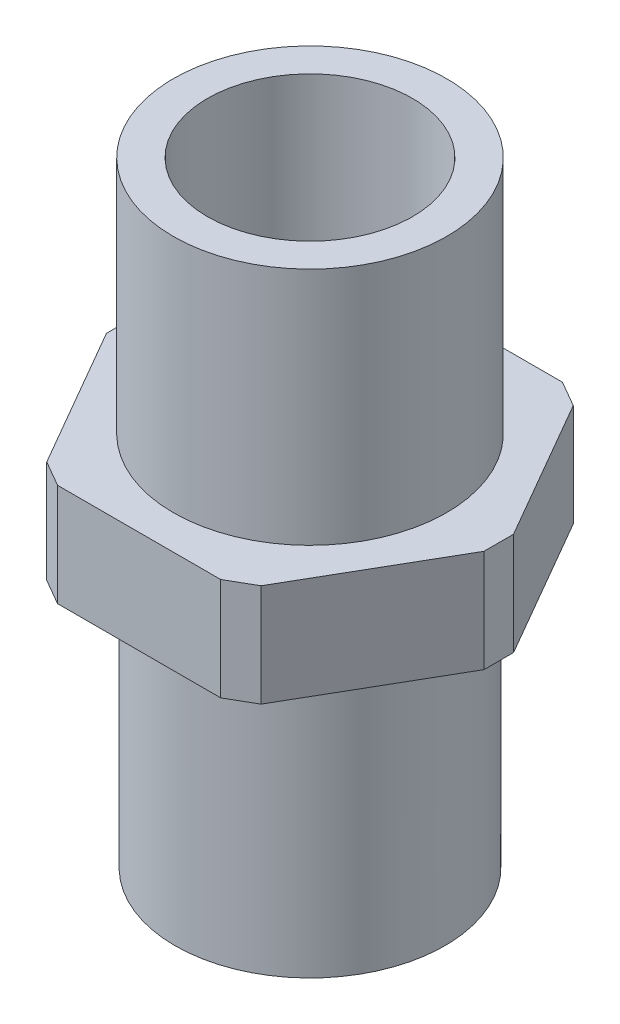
from build123d import *

# Parameters (mm, degrees)
EXTRUSION1_DEPTH = 3
ESQUISSE2_R      = 4
ESQUISSE2_R_2    = 3
EXTRUSION2_DEPTH = 7
ESQUISSE3_R      = 3.95
EXTRUSION3_DEPTH = 8
CHANFREIN1_SIZE  = 0.5


with BuildPart() as part:
    # Esquisse1 → Extrusion1 (new body)
    with BuildSketch(Plane(origin=(0, 0, 0), x_dir=(1, 0, 0), z_dir=(0, 1, 0))):
        Polygon((5.773502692, 0), (2.886751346, 5), (-2.886751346, 5), (-5.773502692, 0), (-2.886751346, -5), (2.886751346, -5), align=None)
    extrude(amount=EXTRUSION1_DEPTH)

    # Esquisse2 → Extrusion2 (add)
    with BuildSketch(Plane(origin=(0, 3, 0), x_dir=(1, 0, 0), z_dir=(0, 1, 0))):
        with Locations(Location((0, 0, 0), (0, 0, 270))):
            Circle(ESQUISSE2_R)
        with Locations(Location((0, 0, 0), (0, 0, 270))):
            Circle(ESQUISSE2_R_2, mode=Mode.SUBTRACT)
    extrude(amount=EXTRUSION2_DEPTH)

    # Esquisse3 → Extrusion3 (add)
    with BuildSketch(Plane.XZ):
        with Locations(Location((0, 0, 0), (0, 0, 90))):
            Circle(ESQUISSE3_R)
    extrude(amount=EXTRUSION3_DEPTH)

    # Chanfrein1
    chanfrein1_edges = [part.edges().sort_by_distance(p)[0] for p in [
        (2.886751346, 1.5, 5),
        (-2.886751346, 1.5, 5),
        (-5.773502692, 1.5, 0),
        (-2.886751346, 1.5, -5),
        (2.886751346, 1.5, -5),
        (5.773502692, 1.5, 0),
    ]]
    chamfer(chanfrein1_edges, length=CHANFREIN1_SIZE)


solid = part.part
